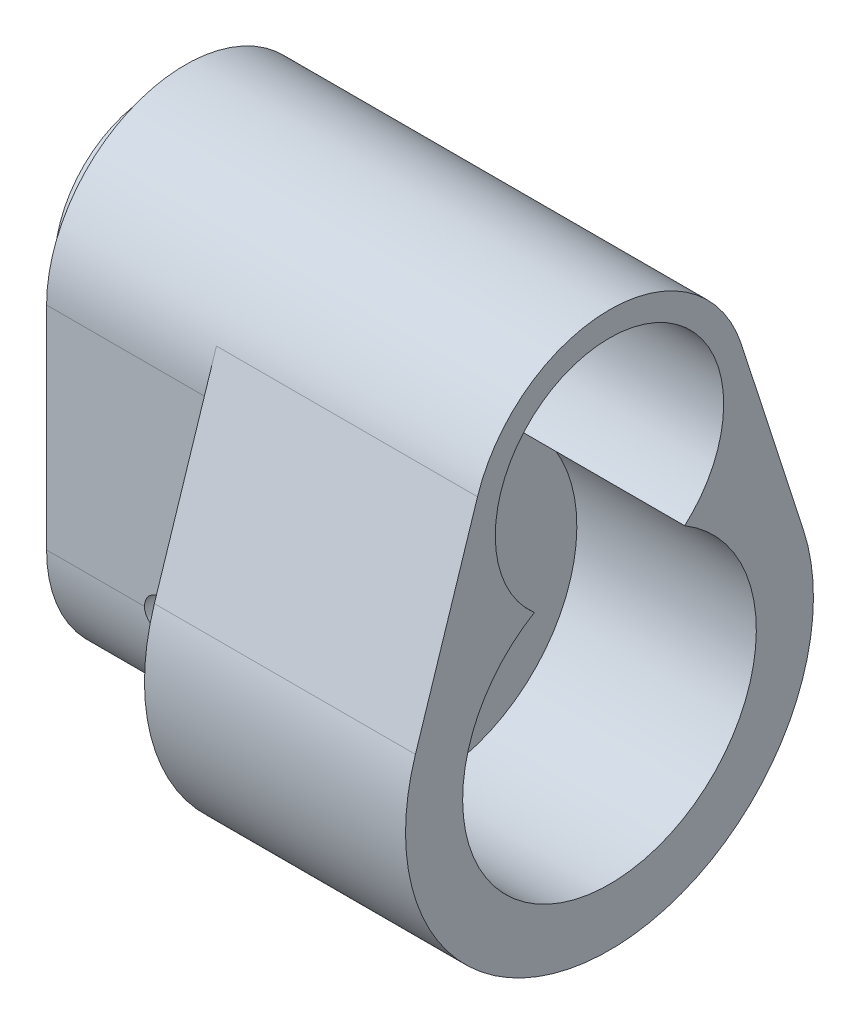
from build123d import *

# Parameters (mm, degrees)
EXTRUDE_2_DEPTH     = 32
EXTRUDE_START       = 20
EXTRUDE_3_DEPTH     = 20
SKETCH_4_R          = 10
SKETCH_4_R_2        = 8
CUT_EXTRUDE_1_DEPTH = 72.95832127
CUT_EXTRUDE_3_DEPTH = 22
EXTRUDE_START_2     = 4
SKETCH_6_R          = 12
SKETCH_6_R_2        = 10
EXTRUDE_4_DEPTH     = 4
SKETCH_7_R          = 2
CUT_EXTRUDE_4_DEPTH = 69.095521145


with BuildPart() as part:
    # Sketch 2 → Extrude 2 (new body)
    with BuildSketch(Plane(origin=(0, 0, 0), x_dir=(0, 0, -1), z_dir=(1, 0, 0))):
        with BuildLine():
            Line((-16.175260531, 31.230769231), (-23.78714784, 7.692307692))
            ThreePointArc((-23.78714784, 7.692307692), (0, -25), (23.78714784, 7.692307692))
            Line((23.78714784, 7.692307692), (16.175260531, 31.230769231))
            ThreePointArc((16.175260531, 31.230769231), (0, 43), (-16.175260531, 31.230769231))
        make_face()
    extrude(amount=EXTRUDE_2_DEPTH)

    # Sketch 3 → Extrude 3 (add)
    with BuildSketch(Plane.ZY.offset(EXTRUDE_START)):
        with BuildLine():
            Line((17, 26), (17, 0))
            ThreePointArc((17, 0), (0, -17), (-17, 0))
            Line((-17, 0), (-17, 26))
            ThreePointArc((-17, 26), (0, 43), (17, 26))
        make_face()
    extrude(amount=-EXTRUDE_3_DEPTH)

    # Sketch 4 → Cut-Extrude 1 (cut, through all)
    with BuildSketch(Plane.ZY.offset(20)):
        with Locations((0, 26)):
            Circle(SKETCH_4_R)
        Circle(SKETCH_4_R_2)
    extrude(amount=-CUT_EXTRUDE_1_DEPTH, mode=Mode.SUBTRACT)

    # Sketch 5 → Cut-Extrude 3 (cut)
    with BuildSketch(Plane(origin=(32, 0, 0), x_dir=(0, 0, -1), z_dir=(1, 0, 0))):
        with BuildLine():
            ThreePointArc((9.216334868, 15.461538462), (0, 40), (-9.216334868, 15.461538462))
            ThreePointArc((-9.216334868, 15.461538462), (0, -18), (9.216334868, 15.461538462))
        make_face()
    extrude(amount=-CUT_EXTRUDE_3_DEPTH, mode=Mode.SUBTRACT)

    # Sketch 6 → Extrude 4 (add)
    with BuildSketch(Plane.ZY.offset(20).offset(EXTRUDE_START_2)):
        with Locations((0, 26)):
            Circle(SKETCH_6_R)
        with Locations((0, 26)):
            Circle(SKETCH_6_R_2, mode=Mode.SUBTRACT)
    extrude(amount=-EXTRUDE_4_DEPTH)

    # Sketch 7 → Cut-Extrude 4 (cut, through all)
    with BuildSketch(Plane.XY.offset(17)):
        with Locations((-6, 0)):
            Circle(SKETCH_7_R)
    extrude(amount=-CUT_EXTRUDE_4_DEPTH, mode=Mode.SUBTRACT)


solid = part.part
